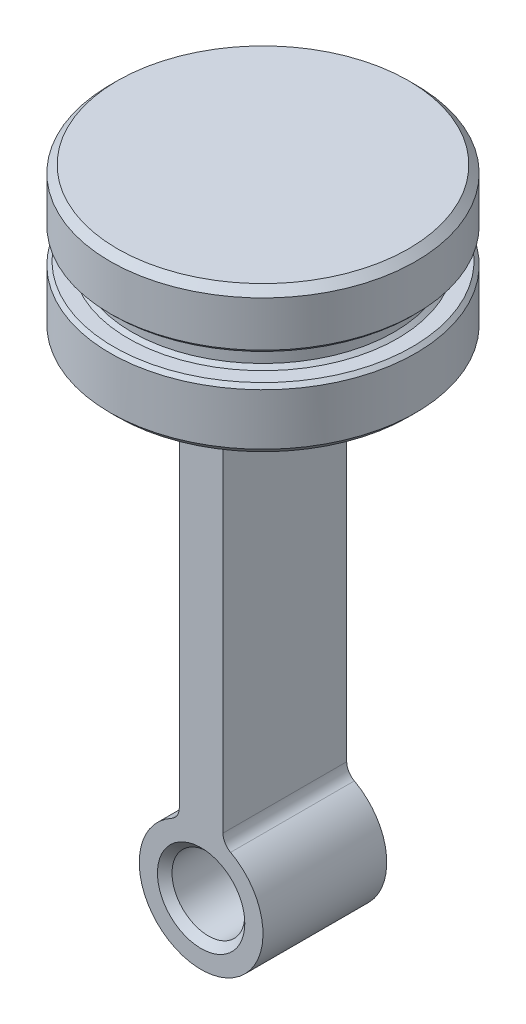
ISO-10303-21;
HEADER;
FILE_DESCRIPTION(('STEP AP214'),'2;1');
FILE_NAME('part.step','',(''),(''),'','','');
FILE_SCHEMA(('AUTOMOTIVE_DESIGN { 1 0 10303 214 1 1 1 1 }'));
ENDSEC;
DATA;
#1=APPLICATION_CONTEXT('core data for automotive mechanical design processes');
#2=APPLICATION_PROTOCOL_DEFINITION('international standard','automotive_design',2000,#1);
#3=PRODUCT_CONTEXT('',#1,'mechanical');
#4=PRODUCT('Part','Part','',(#3));
#5=PRODUCT_RELATED_PRODUCT_CATEGORY('part','',(#4));
#6=PRODUCT_DEFINITION_FORMATION('','',#4);
#7=PRODUCT_DEFINITION_CONTEXT('part definition',#1,'design');
#8=PRODUCT_DEFINITION('design','',#6,#7);
#9=PRODUCT_DEFINITION_SHAPE('','',#8);
#10=(LENGTH_UNIT() NAMED_UNIT(*) SI_UNIT(.MILLI.,.METRE.));
#11=(NAMED_UNIT(*) PLANE_ANGLE_UNIT() SI_UNIT($,.RADIAN.));
#12=(NAMED_UNIT(*) SI_UNIT($,.STERADIAN.) SOLID_ANGLE_UNIT());
#13=UNCERTAINTY_MEASURE_WITH_UNIT(LENGTH_MEASURE(1.E-05),#10,'distance_accuracy_value','');
#14=(GEOMETRIC_REPRESENTATION_CONTEXT(3) GLOBAL_UNCERTAINTY_ASSIGNED_CONTEXT((#13)) GLOBAL_UNIT_ASSIGNED_CONTEXT((#10,
#11,#12)) REPRESENTATION_CONTEXT('',''));
#15=CARTESIAN_POINT('',(0.,0.,0.));
#16=DIRECTION('',(0.,0.,1.));
#17=DIRECTION('',(1.,0.,0.));
#18=AXIS2_PLACEMENT_3D('',#15,#16,#17);
#19=CARTESIAN_POINT('',(1.5,31.5,-8.5));
#20=DIRECTION('',(1.,0.,0.));
#21=DIRECTION('',(0.,1.,0.));
#22=AXIS2_PLACEMENT_3D('',#19,#20,#21);
#23=PLANE('',#22);
#24=DIRECTION('',(0.,1.,0.));
#25=VECTOR('',#24,1.);
#26=CARTESIAN_POINT('',(1.5,31.5,-8.5));
#27=LINE('',#26,#25);
#28=CARTESIAN_POINT('',(1.5,4.61654632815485,-8.5));
#29=VERTEX_POINT('',#28);
#30=CARTESIAN_POINT('',(1.5,30.5,-8.5));
#31=VERTEX_POINT('',#30);
#32=EDGE_CURVE('E126',#29,#31,#27,.T.);
#33=ORIENTED_EDGE('',*,*,#32,.T.);
#34=DIRECTION('',(0.,0.,1.));
#35=VECTOR('',#34,1.);
#36=CARTESIAN_POINT('',(1.5,30.5,-8.5));
#37=LINE('',#36,#35);
#38=CARTESIAN_POINT('',(1.5,30.5,0.));
#39=VERTEX_POINT('',#38);
#40=EDGE_CURVE('E50',#31,#39,#37,.T.);
#41=ORIENTED_EDGE('',*,*,#40,.T.);
#42=DIRECTION('',(0.,1.,0.));
#43=VECTOR('',#42,1.);
#44=CARTESIAN_POINT('',(1.5,31.5,0.));
#45=LINE('',#44,#43);
#46=CARTESIAN_POINT('',(1.5,4.61654632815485,0.));
#47=VERTEX_POINT('',#46);
#48=EDGE_CURVE('E121',#47,#39,#45,.T.);
#49=ORIENTED_EDGE('',*,*,#48,.F.);
#50=DIRECTION('',(0.,0.,-1.));
#51=VECTOR('',#50,1.);
#52=CARTESIAN_POINT('',(1.5,4.61654632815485,-8.5));
#53=LINE('',#52,#51);
#54=EDGE_CURVE('E128',#47,#29,#53,.T.);
#55=ORIENTED_EDGE('',*,*,#54,.T.);
#56=EDGE_LOOP('',(#33,#41,#49,#55));
#57=FACE_BOUND('',#56,.T.);
#58=ADVANCED_FACE('F35',(#57),#23,.T.);
#59=CARTESIAN_POINT('',(0.,0.,-8.5));
#60=DIRECTION('',(0.,0.,1.));
#61=DIRECTION('',(1.,0.,0.));
#62=AXIS2_PLACEMENT_3D('',#59,#60,#61);
#63=CYLINDRICAL_SURFACE('',#62,4.25);
#64=CARTESIAN_POINT('',(0.,0.,-8.5));
#65=DIRECTION('',(0.,0.,1.));
#66=DIRECTION('',(1.,0.,0.));
#67=AXIS2_PLACEMENT_3D('',#64,#65,#66);
#68=CIRCLE('',#67,4.25);
#69=CARTESIAN_POINT('',(-2.02380952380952,3.73720417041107,-8.5));
#70=VERTEX_POINT('',#69);
#71=CARTESIAN_POINT('',(2.02380952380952,3.73720417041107,-8.5));
#72=VERTEX_POINT('',#71);
#73=EDGE_CURVE('E130',#70,#72,#68,.T.);
#74=ORIENTED_EDGE('',*,*,#73,.T.);
#75=DIRECTION('',(0.,0.,1.));
#76=VECTOR('',#75,1.);
#77=CARTESIAN_POINT('',(2.02380952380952,3.73720417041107,-8.5));
#78=LINE('',#77,#76);
#79=CARTESIAN_POINT('',(2.02380952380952,3.73720417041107,0.));
#80=VERTEX_POINT('',#79);
#81=EDGE_CURVE('E120',#72,#80,#78,.T.);
#82=ORIENTED_EDGE('',*,*,#81,.T.);
#83=CARTESIAN_POINT('',(0.,0.,0.));
#84=DIRECTION('',(0.,0.,1.));
#85=DIRECTION('',(1.,0.,0.));
#86=AXIS2_PLACEMENT_3D('',#83,#84,#85);
#87=CIRCLE('',#86,4.25);
#88=CARTESIAN_POINT('',(-2.02380952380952,3.73720417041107,0.));
#89=VERTEX_POINT('',#88);
#90=EDGE_CURVE('E104',#89,#80,#87,.T.);
#91=ORIENTED_EDGE('',*,*,#90,.F.);
#92=DIRECTION('',(0.,0.,1.));
#93=VECTOR('',#92,1.);
#94=CARTESIAN_POINT('',(-2.02380952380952,3.73720417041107,-8.5));
#95=LINE('',#94,#93);
#96=EDGE_CURVE('E117',#89,#70,#95,.F.);
#97=ORIENTED_EDGE('',*,*,#96,.T.);
#98=EDGE_LOOP('',(#74,#82,#91,#97));
#99=FACE_BOUND('',#98,.T.);
#100=ADVANCED_FACE('F116',(#99),#63,.T.);
#101=CARTESIAN_POINT('',(-1.5,31.5,-8.5));
#102=DIRECTION('',(-1.,0.,0.));
#103=DIRECTION('',(0.,-1.,0.));
#104=AXIS2_PLACEMENT_3D('',#101,#102,#103);
#105=PLANE('',#104);
#106=DIRECTION('',(0.,-1.,0.));
#107=VECTOR('',#106,1.);
#108=CARTESIAN_POINT('',(-1.5,31.5,0.));
#109=LINE('',#108,#107);
#110=CARTESIAN_POINT('',(-1.5,30.5,0.));
#111=VERTEX_POINT('',#110);
#112=CARTESIAN_POINT('',(-1.5,4.61654632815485,0.));
#113=VERTEX_POINT('',#112);
#114=EDGE_CURVE('E105',#111,#113,#109,.T.);
#115=ORIENTED_EDGE('',*,*,#114,.F.);
#116=DIRECTION('',(0.,0.,1.));
#117=VECTOR('',#116,1.);
#118=CARTESIAN_POINT('',(-1.5,30.5,-8.5));
#119=LINE('',#118,#117);
#120=CARTESIAN_POINT('',(-1.5,30.5,-8.5));
#121=VERTEX_POINT('',#120);
#122=EDGE_CURVE('E165',#111,#121,#119,.F.);
#123=ORIENTED_EDGE('',*,*,#122,.T.);
#124=DIRECTION('',(0.,-1.,0.));
#125=VECTOR('',#124,1.);
#126=CARTESIAN_POINT('',(-1.5,31.5,-8.5));
#127=LINE('',#126,#125);
#128=CARTESIAN_POINT('',(-1.5,4.61654632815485,-8.5));
#129=VERTEX_POINT('',#128);
#130=EDGE_CURVE('E332',#121,#129,#127,.T.);
#131=ORIENTED_EDGE('',*,*,#130,.T.);
#132=DIRECTION('',(0.,0.,-1.));
#133=VECTOR('',#132,1.);
#134=CARTESIAN_POINT('',(-1.5,4.61654632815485,0.));
#135=LINE('',#134,#133);
#136=EDGE_CURVE('E135',#129,#113,#135,.F.);
#137=ORIENTED_EDGE('',*,*,#136,.T.);
#138=EDGE_LOOP('',(#115,#123,#131,#137));
#139=FACE_BOUND('',#138,.T.);
#140=ADVANCED_FACE('F234',(#139),#105,.T.);
#141=CARTESIAN_POINT('',(0.,0.,-8.5));
#142=DIRECTION('',(0.,0.,1.));
#143=DIRECTION('',(1.,0.,0.));
#144=AXIS2_PLACEMENT_3D('',#141,#142,#143);
#145=PLANE('',#144);
#146=CARTESIAN_POINT('',(0.,0.,-8.5));
#147=DIRECTION('',(0.,0.,1.));
#148=DIRECTION('',(1.,0.,0.));
#149=AXIS2_PLACEMENT_3D('',#146,#147,#148);
#150=CIRCLE('',#149,3.);
#151=CARTESIAN_POINT('',(3.,0.,-8.5));
#152=VERTEX_POINT('',#151);
#153=EDGE_CURVE('E141',#152,#152,#150,.T.);
#154=ORIENTED_EDGE('',*,*,#153,.T.);
#155=EDGE_LOOP('',(#154));
#156=FACE_BOUND('',#155,.T.);
#157=ORIENTED_EDGE('',*,*,#130,.F.);
#158=DIRECTION('',(-1.,0.,0.));
#159=VECTOR('',#158,1.);
#160=CARTESIAN_POINT('',(1.5,30.5,-8.5));
#161=LINE('',#160,#159);
#162=EDGE_CURVE('E162',#121,#31,#161,.F.);
#163=ORIENTED_EDGE('',*,*,#162,.T.);
#164=ORIENTED_EDGE('',*,*,#32,.F.);
#165=CARTESIAN_POINT('',(2.5,4.61654632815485,-8.5));
#166=DIRECTION('',(0.,0.,1.));
#167=DIRECTION('',(1.,0.,0.));
#168=AXIS2_PLACEMENT_3D('',#165,#166,#167);
#169=CIRCLE('',#168,1.);
#170=EDGE_CURVE('E111',#29,#72,#169,.T.);
#171=ORIENTED_EDGE('',*,*,#170,.T.);
#172=ORIENTED_EDGE('',*,*,#73,.F.);
#173=CARTESIAN_POINT('',(-2.5,4.61654632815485,-8.5));
#174=DIRECTION('',(0.,0.,1.));
#175=DIRECTION('',(1.,0.,0.));
#176=AXIS2_PLACEMENT_3D('',#173,#174,#175);
#177=CIRCLE('',#176,1.);
#178=EDGE_CURVE('E110',#70,#129,#177,.T.);
#179=ORIENTED_EDGE('',*,*,#178,.T.);
#180=EDGE_LOOP('',(#157,#163,#164,#171,#172,#179));
#181=FACE_BOUND('',#180,.T.);
#182=ADVANCED_FACE('F240',(#156,#181),#145,.F.);
#183=CARTESIAN_POINT('',(0.,0.,0.));
#184=DIRECTION('',(0.,0.,1.));
#185=DIRECTION('',(1.,0.,0.));
#186=AXIS2_PLACEMENT_3D('',#183,#184,#185);
#187=PLANE('',#186);
#188=CARTESIAN_POINT('',(0.,0.,0.));
#189=DIRECTION('',(0.,0.,1.));
#190=DIRECTION('',(1.,0.,0.));
#191=AXIS2_PLACEMENT_3D('',#188,#189,#190);
#192=CIRCLE('',#191,3.);
#193=CARTESIAN_POINT('',(3.,0.,0.));
#194=VERTEX_POINT('',#193);
#195=EDGE_CURVE('E150',#194,#194,#192,.F.);
#196=ORIENTED_EDGE('',*,*,#195,.T.);
#197=EDGE_LOOP('',(#196));
#198=FACE_BOUND('',#197,.T.);
#199=ORIENTED_EDGE('',*,*,#48,.T.);
#200=DIRECTION('',(-1.,0.,0.));
#201=VECTOR('',#200,1.);
#202=CARTESIAN_POINT('',(0.,30.5,0.));
#203=LINE('',#202,#201);
#204=EDGE_CURVE('E57',#39,#111,#203,.T.);
#205=ORIENTED_EDGE('',*,*,#204,.T.);
#206=ORIENTED_EDGE('',*,*,#114,.T.);
#207=CARTESIAN_POINT('',(-2.5,4.61654632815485,0.));
#208=DIRECTION('',(0.,0.,1.));
#209=DIRECTION('',(1.,0.,0.));
#210=AXIS2_PLACEMENT_3D('',#207,#208,#209);
#211=CIRCLE('',#210,1.);
#212=EDGE_CURVE('E101',#113,#89,#211,.F.);
#213=ORIENTED_EDGE('',*,*,#212,.T.);
#214=ORIENTED_EDGE('',*,*,#90,.T.);
#215=CARTESIAN_POINT('',(2.5,4.61654632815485,0.));
#216=DIRECTION('',(0.,0.,1.));
#217=DIRECTION('',(1.,0.,0.));
#218=AXIS2_PLACEMENT_3D('',#215,#216,#217);
#219=CIRCLE('',#218,1.);
#220=EDGE_CURVE('E137',#80,#47,#219,.F.);
#221=ORIENTED_EDGE('',*,*,#220,.T.);
#222=EDGE_LOOP('',(#199,#205,#206,#213,#214,#221));
#223=FACE_BOUND('',#222,.T.);
#224=ADVANCED_FACE('F103',(#198,#223),#187,.T.);
#225=CARTESIAN_POINT('',(0.,0.,-8.5));
#226=DIRECTION('',(0.,0.,1.));
#227=DIRECTION('',(1.,0.,0.));
#228=AXIS2_PLACEMENT_3D('',#225,#226,#227);
#229=CYLINDRICAL_SURFACE('',#228,2.5);
#230=CARTESIAN_POINT('',(0.,0.,-8.));
#231=DIRECTION('',(0.,0.,1.));
#232=DIRECTION('',(1.,0.,0.));
#233=AXIS2_PLACEMENT_3D('',#230,#231,#232);
#234=CIRCLE('',#233,2.5);
#235=CARTESIAN_POINT('',(2.5,0.,-8.));
#236=VERTEX_POINT('',#235);
#237=EDGE_CURVE('E147',#236,#236,#234,.F.);
#238=ORIENTED_EDGE('',*,*,#237,.T.);
#239=EDGE_LOOP('',(#238));
#240=FACE_BOUND('',#239,.T.);
#241=CARTESIAN_POINT('',(0.,0.,-0.499999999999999));
#242=DIRECTION('',(0.,0.,1.));
#243=DIRECTION('',(1.,0.,0.));
#244=AXIS2_PLACEMENT_3D('',#241,#242,#243);
#245=CIRCLE('',#244,2.5);
#246=CARTESIAN_POINT('',(2.5,0.,-0.499999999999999));
#247=VERTEX_POINT('',#246);
#248=EDGE_CURVE('E144',#247,#247,#245,.T.);
#249=ORIENTED_EDGE('',*,*,#248,.T.);
#250=EDGE_LOOP('',(#249));
#251=FACE_BOUND('',#250,.T.);
#252=ADVANCED_FACE('F245',(#240,#251),#229,.F.);
#253=CARTESIAN_POINT('',(2.5,4.61654632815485,-8.5));
#254=DIRECTION('',(0.,0.,1.));
#255=DIRECTION('',(1.,0.,0.));
#256=AXIS2_PLACEMENT_3D('',#253,#254,#255);
#257=CYLINDRICAL_SURFACE('',#256,1.);
#258=ORIENTED_EDGE('',*,*,#170,.F.);
#259=ORIENTED_EDGE('',*,*,#54,.F.);
#260=ORIENTED_EDGE('',*,*,#220,.F.);
#261=ORIENTED_EDGE('',*,*,#81,.F.);
#262=EDGE_LOOP('',(#258,#259,#260,#261));
#263=FACE_BOUND('',#262,.T.);
#264=ADVANCED_FACE('F242',(#263),#257,.F.);
#265=CARTESIAN_POINT('',(-2.5,4.61654632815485,-8.5));
#266=DIRECTION('',(0.,0.,1.));
#267=DIRECTION('',(1.,0.,0.));
#268=AXIS2_PLACEMENT_3D('',#265,#266,#267);
#269=CYLINDRICAL_SURFACE('',#268,1.);
#270=ORIENTED_EDGE('',*,*,#178,.F.);
#271=ORIENTED_EDGE('',*,*,#96,.F.);
#272=ORIENTED_EDGE('',*,*,#212,.F.);
#273=ORIENTED_EDGE('',*,*,#136,.F.);
#274=EDGE_LOOP('',(#270,#271,#272,#273));
#275=FACE_BOUND('',#274,.T.);
#276=ADVANCED_FACE('F124',(#275),#269,.F.);
#277=CARTESIAN_POINT('',(0.,0.,-8.5));
#278=DIRECTION('',(0.,0.,-1.));
#279=DIRECTION('',(-1.,0.,0.));
#280=AXIS2_PLACEMENT_3D('',#277,#278,#279);
#281=CONICAL_SURFACE('',#280,3.,0.785398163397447);
#282=ORIENTED_EDGE('',*,*,#237,.F.);
#283=EDGE_LOOP('',(#282));
#284=FACE_BOUND('',#283,.T.);
#285=ORIENTED_EDGE('',*,*,#153,.F.);
#286=EDGE_LOOP('',(#285));
#287=FACE_BOUND('',#286,.T.);
#288=ADVANCED_FACE('F249',(#284,#287),#281,.F.);
#289=CARTESIAN_POINT('',(0.,0.,-0.499999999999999));
#290=DIRECTION('',(0.,0.,1.));
#291=DIRECTION('',(1.,0.,0.));
#292=AXIS2_PLACEMENT_3D('',#289,#290,#291);
#293=CONICAL_SURFACE('',#292,2.5,0.78539816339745);
#294=ORIENTED_EDGE('',*,*,#195,.F.);
#295=EDGE_LOOP('',(#294));
#296=FACE_BOUND('',#295,.T.);
#297=ORIENTED_EDGE('',*,*,#248,.F.);
#298=EDGE_LOOP('',(#297));
#299=FACE_BOUND('',#298,.T.);
#300=ADVANCED_FACE('F252',(#296,#299),#293,.F.);
#301=CARTESIAN_POINT('',(0.,31.5,-4.25));
#302=DIRECTION('',(0.,1.,0.));
#303=DIRECTION('',(0.,0.,1.));
#304=AXIS2_PLACEMENT_3D('',#301,#302,#303);
#305=PLANE('',#304);
#306=CARTESIAN_POINT('',(0.,31.5,-4.25));
#307=DIRECTION('',(0.,1.,0.));
#308=DIRECTION('',(0.,0.,1.));
#309=AXIS2_PLACEMENT_3D('',#306,#307,#308);
#310=CIRCLE('',#309,10.);
#311=CARTESIAN_POINT('',(0.,31.5,5.75));
#312=VERTEX_POINT('',#311);
#313=EDGE_CURVE('E185',#312,#312,#310,.F.);
#314=ORIENTED_EDGE('',*,*,#313,.T.);
#315=EDGE_LOOP('',(#314));
#316=FACE_BOUND('',#315,.T.);
#317=DIRECTION('',(0.,0.,1.));
#318=VECTOR('',#317,1.);
#319=CARTESIAN_POINT('',(2.5,31.5,-4.25));
#320=LINE('',#319,#318);
#321=CARTESIAN_POINT('',(2.5,31.5,1.));
#322=VERTEX_POINT('',#321);
#323=CARTESIAN_POINT('',(2.5,31.5,-9.5));
#324=VERTEX_POINT('',#323);
#325=EDGE_CURVE('E153',#322,#324,#320,.F.);
#326=ORIENTED_EDGE('',*,*,#325,.T.);
#327=DIRECTION('',(-1.,0.,0.));
#328=VECTOR('',#327,1.);
#329=CARTESIAN_POINT('',(-1.5,31.5,-9.5));
#330=LINE('',#329,#328);
#331=CARTESIAN_POINT('',(-2.5,31.5,-9.5));
#332=VERTEX_POINT('',#331);
#333=EDGE_CURVE('E159',#324,#332,#330,.T.);
#334=ORIENTED_EDGE('',*,*,#333,.T.);
#335=DIRECTION('',(0.,0.,1.));
#336=VECTOR('',#335,1.);
#337=CARTESIAN_POINT('',(-2.5,31.5,-4.25));
#338=LINE('',#337,#336);
#339=CARTESIAN_POINT('',(-2.5,31.5,1.));
#340=VERTEX_POINT('',#339);
#341=EDGE_CURVE('E157',#332,#340,#338,.T.);
#342=ORIENTED_EDGE('',*,*,#341,.T.);
#343=DIRECTION('',(-1.,0.,0.));
#344=VECTOR('',#343,1.);
#345=CARTESIAN_POINT('',(0.,31.5,1.));
#346=LINE('',#345,#344);
#347=EDGE_CURVE('E155',#340,#322,#346,.F.);
#348=ORIENTED_EDGE('',*,*,#347,.T.);
#349=EDGE_LOOP('',(#326,#334,#342,#348));
#350=FACE_BOUND('',#349,.T.);
#351=ADVANCED_FACE('F256',(#316,#350),#305,.F.);
#352=CARTESIAN_POINT('',(0.,41.5,-4.25));
#353=DIRECTION('',(0.,-1.,0.));
#354=DIRECTION('',(0.,0.,-1.));
#355=AXIS2_PLACEMENT_3D('',#352,#353,#354);
#356=CYLINDRICAL_SURFACE('',#355,10.5);
#357=CARTESIAN_POINT('',(0.,35.5397229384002,-4.25));
#358=DIRECTION('',(0.,-1.,0.));
#359=DIRECTION('',(0.,0.,-1.));
#360=AXIS2_PLACEMENT_3D('',#357,#358,#359);
#361=CIRCLE('',#360,10.5);
#362=CARTESIAN_POINT('',(0.,35.5397229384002,-14.75));
#363=VERTEX_POINT('',#362);
#364=EDGE_CURVE('E197',#363,#363,#361,.T.);
#365=ORIENTED_EDGE('',*,*,#364,.T.);
#366=EDGE_LOOP('',(#365));
#367=FACE_BOUND('',#366,.T.);
#368=CARTESIAN_POINT('',(0.,32.,-4.25));
#369=DIRECTION('',(0.,1.,0.));
#370=DIRECTION('',(0.,0.,1.));
#371=AXIS2_PLACEMENT_3D('',#368,#369,#370);
#372=CIRCLE('',#371,10.5);
#373=CARTESIAN_POINT('',(0.,32.,6.25));
#374=VERTEX_POINT('',#373);
#375=EDGE_CURVE('E182',#374,#374,#372,.T.);
#376=ORIENTED_EDGE('',*,*,#375,.T.);
#377=EDGE_LOOP('',(#376));
#378=FACE_BOUND('',#377,.T.);
#379=ADVANCED_FACE('F274',(#367,#378),#356,.T.);
#380=CARTESIAN_POINT('',(0.,30.5,1.));
#381=DIRECTION('',(-1.,0.,0.));
#382=DIRECTION('',(0.,0.,1.));
#383=AXIS2_PLACEMENT_3D('',#380,#381,#382);
#384=CYLINDRICAL_SURFACE('',#383,1.);
#385=CARTESIAN_POINT('',(-2.5,30.5,1.));
#386=DIRECTION('',(-0.707106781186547,0.,-0.707106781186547));
#387=DIRECTION('',(-0.707106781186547,0.,0.707106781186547));
#388=AXIS2_PLACEMENT_3D('',#385,#386,#387);
#389=ELLIPSE('',#388,1.41421356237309,1.);
#390=EDGE_CURVE('E174',#111,#340,#389,.F.);
#391=ORIENTED_EDGE('',*,*,#390,.F.);
#392=ORIENTED_EDGE('',*,*,#204,.F.);
#393=CARTESIAN_POINT('',(2.5,30.5,1.));
#394=DIRECTION('',(-0.707106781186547,0.,0.707106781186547));
#395=DIRECTION('',(0.707106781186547,0.,0.707106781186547));
#396=AXIS2_PLACEMENT_3D('',#393,#394,#395);
#397=ELLIPSE('',#396,1.41421356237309,1.);
#398=EDGE_CURVE('E177',#322,#39,#397,.T.);
#399=ORIENTED_EDGE('',*,*,#398,.F.);
#400=ORIENTED_EDGE('',*,*,#347,.F.);
#401=EDGE_LOOP('',(#391,#392,#399,#400));
#402=FACE_BOUND('',#401,.T.);
#403=ADVANCED_FACE('F270',(#402),#384,.F.);
#404=CARTESIAN_POINT('',(2.5,30.5,-8.5));
#405=DIRECTION('',(0.,0.,1.));
#406=DIRECTION('',(1.,0.,0.));
#407=AXIS2_PLACEMENT_3D('',#404,#405,#406);
#408=CYLINDRICAL_SURFACE('',#407,1.);
#409=ORIENTED_EDGE('',*,*,#398,.T.);
#410=ORIENTED_EDGE('',*,*,#40,.F.);
#411=CARTESIAN_POINT('',(2.5,30.5,-9.5));
#412=DIRECTION('',(0.707106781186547,0.,0.707106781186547));
#413=DIRECTION('',(-0.707106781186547,0.,0.707106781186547));
#414=AXIS2_PLACEMENT_3D('',#411,#412,#413);
#415=ELLIPSE('',#414,1.41421356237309,1.);
#416=EDGE_CURVE('E172',#324,#31,#415,.T.);
#417=ORIENTED_EDGE('',*,*,#416,.F.);
#418=ORIENTED_EDGE('',*,*,#325,.F.);
#419=EDGE_LOOP('',(#409,#410,#417,#418));
#420=FACE_BOUND('',#419,.T.);
#421=ADVANCED_FACE('F266',(#420),#408,.F.);
#422=CARTESIAN_POINT('',(-2.5,30.5,-4.25));
#423=DIRECTION('',(0.,0.,1.));
#424=DIRECTION('',(1.,0.,0.));
#425=AXIS2_PLACEMENT_3D('',#422,#423,#424);
#426=CYLINDRICAL_SURFACE('',#425,1.);
#427=ORIENTED_EDGE('',*,*,#390,.T.);
#428=ORIENTED_EDGE('',*,*,#341,.F.);
#429=CARTESIAN_POINT('',(-2.5,30.5,-9.5));
#430=DIRECTION('',(-0.707106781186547,0.,0.707106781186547));
#431=DIRECTION('',(0.707106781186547,0.,0.707106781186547));
#432=AXIS2_PLACEMENT_3D('',#429,#430,#431);
#433=ELLIPSE('',#432,1.41421356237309,1.);
#434=EDGE_CURVE('E170',#121,#332,#433,.T.);
#435=ORIENTED_EDGE('',*,*,#434,.F.);
#436=ORIENTED_EDGE('',*,*,#122,.F.);
#437=EDGE_LOOP('',(#427,#428,#435,#436));
#438=FACE_BOUND('',#437,.T.);
#439=ADVANCED_FACE('F262',(#438),#426,.F.);
#440=CARTESIAN_POINT('',(0.,30.5,-9.5));
#441=DIRECTION('',(1.,0.,0.));
#442=DIRECTION('',(0.,0.,-1.));
#443=AXIS2_PLACEMENT_3D('',#440,#441,#442);
#444=CYLINDRICAL_SURFACE('',#443,1.);
#445=ORIENTED_EDGE('',*,*,#416,.T.);
#446=ORIENTED_EDGE('',*,*,#162,.F.);
#447=ORIENTED_EDGE('',*,*,#434,.T.);
#448=ORIENTED_EDGE('',*,*,#333,.F.);
#449=EDGE_LOOP('',(#445,#446,#447,#448));
#450=FACE_BOUND('',#449,.T.);
#451=ADVANCED_FACE('F258',(#450),#444,.F.);
#452=CARTESIAN_POINT('',(0.,32.,-4.25));
#453=DIRECTION('',(0.,1.,0.));
#454=DIRECTION('',(0.,0.,1.));
#455=AXIS2_PLACEMENT_3D('',#452,#453,#454);
#456=CONICAL_SURFACE('',#455,10.5,0.785398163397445);
#457=ORIENTED_EDGE('',*,*,#313,.F.);
#458=EDGE_LOOP('',(#457));
#459=FACE_BOUND('',#458,.T.);
#460=ORIENTED_EDGE('',*,*,#375,.F.);
#461=EDGE_LOOP('',(#460));
#462=FACE_BOUND('',#461,.T.);
#463=ADVANCED_FACE('F261',(#459,#462),#456,.T.);
#464=CARTESIAN_POINT('',(0.,37.6405218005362,6.25));
#465=DIRECTION('',(0.,1.,0.));
#466=DIRECTION('',(0.,0.,1.));
#467=AXIS2_PLACEMENT_3D('',#464,#465,#466);
#468=PLANE('',#467);
#469=CARTESIAN_POINT('',(0.,37.6405218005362,-4.25));
#470=DIRECTION('',(0.,1.,0.));
#471=DIRECTION('',(0.,0.,1.));
#472=AXIS2_PLACEMENT_3D('',#469,#470,#471);
#473=CIRCLE('',#472,9.24999999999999);
#474=CARTESIAN_POINT('',(0.,37.6405218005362,4.99999999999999));
#475=VERTEX_POINT('',#474);
#476=EDGE_CURVE('E43',#475,#475,#473,.T.);
#477=ORIENTED_EDGE('',*,*,#476,.T.);
#478=EDGE_LOOP('',(#477));
#479=FACE_BOUND('',#478,.T.);
#480=CARTESIAN_POINT('',(0.,37.6405218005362,-4.25));
#481=DIRECTION('',(0.,1.,0.));
#482=DIRECTION('',(0.,0.,1.));
#483=AXIS2_PLACEMENT_3D('',#480,#481,#482);
#484=CIRCLE('',#483,10.25);
#485=CARTESIAN_POINT('',(0.,37.6405218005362,6.));
#486=VERTEX_POINT('',#485);
#487=EDGE_CURVE('E206',#486,#486,#484,.F.);
#488=ORIENTED_EDGE('',*,*,#487,.T.);
#489=EDGE_LOOP('',(#488));
#490=FACE_BOUND('',#489,.T.);
#491=ADVANCED_FACE('F211',(#479,#490),#468,.F.);
#492=CARTESIAN_POINT('',(0.,41.,-4.25));
#493=DIRECTION('',(0.,1.,0.));
#494=DIRECTION('',(0.,0.,1.));
#495=AXIS2_PLACEMENT_3D('',#492,#493,#494);
#496=CYLINDRICAL_SURFACE('',#495,9.);
#497=CARTESIAN_POINT('',(0.,36.0397229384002,-4.25));
#498=DIRECTION('',(0.,-1.,0.));
#499=DIRECTION('',(0.,0.,-1.));
#500=AXIS2_PLACEMENT_3D('',#497,#498,#499);
#501=CIRCLE('',#500,9.);
#502=CARTESIAN_POINT('',(0.,36.0397229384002,-13.25));
#503=VERTEX_POINT('',#502);
#504=EDGE_CURVE('E203',#503,#503,#501,.F.);
#505=ORIENTED_EDGE('',*,*,#504,.T.);
#506=EDGE_LOOP('',(#505));
#507=FACE_BOUND('',#506,.T.);
#508=CARTESIAN_POINT('',(0.,37.3905218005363,-4.25));
#509=DIRECTION('',(0.,1.,0.));
#510=DIRECTION('',(0.,0.,1.));
#511=AXIS2_PLACEMENT_3D('',#508,#509,#510);
#512=CIRCLE('',#511,9.);
#513=CARTESIAN_POINT('',(0.,37.3905218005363,4.75));
#514=VERTEX_POINT('',#513);
#515=EDGE_CURVE('E200',#514,#514,#512,.F.);
#516=ORIENTED_EDGE('',*,*,#515,.T.);
#517=EDGE_LOOP('',(#516));
#518=FACE_BOUND('',#517,.T.);
#519=ADVANCED_FACE('F299',(#507,#518),#496,.T.);
#520=CARTESIAN_POINT('',(0.,35.7897229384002,4.75));
#521=DIRECTION('',(0.,-1.,0.));
#522=DIRECTION('',(0.,0.,-1.));
#523=AXIS2_PLACEMENT_3D('',#520,#521,#522);
#524=PLANE('',#523);
#525=CARTESIAN_POINT('',(0.,35.7897229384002,-4.25));
#526=DIRECTION('',(0.,-1.,0.));
#527=DIRECTION('',(0.,0.,-1.));
#528=AXIS2_PLACEMENT_3D('',#525,#526,#527);
#529=CIRCLE('',#528,10.25);
#530=CARTESIAN_POINT('',(0.,35.7897229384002,-14.5));
#531=VERTEX_POINT('',#530);
#532=EDGE_CURVE('E194',#531,#531,#529,.F.);
#533=ORIENTED_EDGE('',*,*,#532,.T.);
#534=EDGE_LOOP('',(#533));
#535=FACE_BOUND('',#534,.T.);
#536=CARTESIAN_POINT('',(0.,35.7897229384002,-4.25));
#537=DIRECTION('',(0.,-1.,0.));
#538=DIRECTION('',(0.,0.,-1.));
#539=AXIS2_PLACEMENT_3D('',#536,#537,#538);
#540=CIRCLE('',#539,9.24999999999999);
#541=CARTESIAN_POINT('',(0.,35.7897229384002,-13.5));
#542=VERTEX_POINT('',#541);
#543=EDGE_CURVE('E191',#542,#542,#540,.T.);
#544=ORIENTED_EDGE('',*,*,#543,.T.);
#545=EDGE_LOOP('',(#544));
#546=FACE_BOUND('',#545,.T.);
#547=ADVANCED_FACE('F297',(#535,#546),#524,.F.);
#548=CARTESIAN_POINT('',(0.,41.5,-4.25));
#549=DIRECTION('',(0.,1.,0.));
#550=DIRECTION('',(0.,0.,1.));
#551=AXIS2_PLACEMENT_3D('',#548,#549,#550);
#552=PLANE('',#551);
#553=CARTESIAN_POINT('',(0.,41.5,-4.25));
#554=DIRECTION('',(0.,1.,0.));
#555=DIRECTION('',(0.,0.,1.));
#556=AXIS2_PLACEMENT_3D('',#553,#554,#555);
#557=CIRCLE('',#556,10.);
#558=CARTESIAN_POINT('',(0.,41.5,5.75));
#559=VERTEX_POINT('',#558);
#560=EDGE_CURVE('E188',#559,#559,#557,.T.);
#561=ORIENTED_EDGE('',*,*,#560,.T.);
#562=EDGE_LOOP('',(#561));
#563=FACE_BOUND('',#562,.T.);
#564=ADVANCED_FACE('F283',(#563),#552,.T.);
#565=CARTESIAN_POINT('',(0.,41.5,-4.25));
#566=DIRECTION('',(0.,-1.,0.));
#567=DIRECTION('',(0.,0.,-1.));
#568=AXIS2_PLACEMENT_3D('',#565,#566,#567);
#569=CONICAL_SURFACE('',#568,10.,0.785398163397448);
#570=CARTESIAN_POINT('',(0.,41.,-4.25));
#571=DIRECTION('',(0.,1.,0.));
#572=DIRECTION('',(0.,0.,1.));
#573=AXIS2_PLACEMENT_3D('',#570,#571,#572);
#574=CIRCLE('',#573,10.5);
#575=CARTESIAN_POINT('',(0.,41.,6.25));
#576=VERTEX_POINT('',#575);
#577=EDGE_CURVE('E169',#576,#576,#574,.F.);
#578=ORIENTED_EDGE('',*,*,#577,.F.);
#579=EDGE_LOOP('',(#578));
#580=FACE_BOUND('',#579,.T.);
#581=ORIENTED_EDGE('',*,*,#560,.F.);
#582=EDGE_LOOP('',(#581));
#583=FACE_BOUND('',#582,.T.);
#584=ADVANCED_FACE('F279',(#580,#583),#569,.T.);
#585=CARTESIAN_POINT('',(0.,37.8905218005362,-4.25));
#586=DIRECTION('',(0.,1.,0.));
#587=DIRECTION('',(0.,0.,1.));
#588=AXIS2_PLACEMENT_3D('',#585,#586,#587);
#589=CIRCLE('',#588,10.5);
#590=CARTESIAN_POINT('',(0.,37.8905218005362,6.25));
#591=VERTEX_POINT('',#590);
#592=EDGE_CURVE('E11',#591,#591,#589,.T.);
#593=ORIENTED_EDGE('',*,*,#592,.T.);
#594=EDGE_LOOP('',(#593));
#595=FACE_BOUND('',#594,.T.);
#596=ORIENTED_EDGE('',*,*,#577,.T.);
#597=EDGE_LOOP('',(#596));
#598=FACE_BOUND('',#597,.T.);
#599=ADVANCED_FACE('F282',(#595,#598),#356,.T.);
#600=CARTESIAN_POINT('',(0.,35.7897229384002,-4.25));
#601=DIRECTION('',(0.,-1.,0.));
#602=DIRECTION('',(0.,0.,-1.));
#603=AXIS2_PLACEMENT_3D('',#600,#601,#602);
#604=CONICAL_SURFACE('',#603,10.25,0.785398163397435);
#605=ORIENTED_EDGE('',*,*,#364,.F.);
#606=EDGE_LOOP('',(#605));
#607=FACE_BOUND('',#606,.T.);
#608=ORIENTED_EDGE('',*,*,#532,.F.);
#609=EDGE_LOOP('',(#608));
#610=FACE_BOUND('',#609,.T.);
#611=ADVANCED_FACE('F223',(#607,#610),#604,.T.);
#612=CARTESIAN_POINT('',(0.,36.0397229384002,-4.25));
#613=DIRECTION('',(0.,-1.,0.));
#614=DIRECTION('',(0.,0.,-1.));
#615=AXIS2_PLACEMENT_3D('',#612,#613,#614);
#616=CONICAL_SURFACE('',#615,9.,0.785398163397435);
#617=ORIENTED_EDGE('',*,*,#543,.F.);
#618=EDGE_LOOP('',(#617));
#619=FACE_BOUND('',#618,.T.);
#620=ORIENTED_EDGE('',*,*,#504,.F.);
#621=EDGE_LOOP('',(#620));
#622=FACE_BOUND('',#621,.T.);
#623=ADVANCED_FACE('F216',(#619,#622),#616,.T.);
#624=CARTESIAN_POINT('',(0.,37.6405218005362,-4.25));
#625=DIRECTION('',(0.,1.,0.));
#626=DIRECTION('',(0.,0.,1.));
#627=AXIS2_PLACEMENT_3D('',#624,#625,#626);
#628=CONICAL_SURFACE('',#627,9.24999999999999,0.785398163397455);
#629=ORIENTED_EDGE('',*,*,#515,.F.);
#630=EDGE_LOOP('',(#629));
#631=FACE_BOUND('',#630,.T.);
#632=ORIENTED_EDGE('',*,*,#476,.F.);
#633=EDGE_LOOP('',(#632));
#634=FACE_BOUND('',#633,.T.);
#635=ADVANCED_FACE('F214',(#631,#634),#628,.T.);
#636=CARTESIAN_POINT('',(0.,37.8905218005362,-4.25));
#637=DIRECTION('',(0.,1.,0.));
#638=DIRECTION('',(0.,0.,1.));
#639=AXIS2_PLACEMENT_3D('',#636,#637,#638);
#640=CONICAL_SURFACE('',#639,10.5,0.785398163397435);
#641=ORIENTED_EDGE('',*,*,#487,.F.);
#642=EDGE_LOOP('',(#641));
#643=FACE_BOUND('',#642,.T.);
#644=ORIENTED_EDGE('',*,*,#592,.F.);
#645=EDGE_LOOP('',(#644));
#646=FACE_BOUND('',#645,.T.);
#647=ADVANCED_FACE('F37',(#643,#646),#640,.T.);
#648=CLOSED_SHELL('',(#58,#100,#140,#182,#224,#252,#264,#276,#288,#300,#351,#379,#403,#421,#439,
#451,#463,#491,#519,#547,#564,#584,#599,#611,#623,#635,#647));
#649=MANIFOLD_SOLID_BREP('B2',#648);
#650=ADVANCED_BREP_SHAPE_REPRESENTATION('',(#18,#649),#14);
#651=SHAPE_DEFINITION_REPRESENTATION(#9,#650);
ENDSEC;
END-ISO-10303-21;
